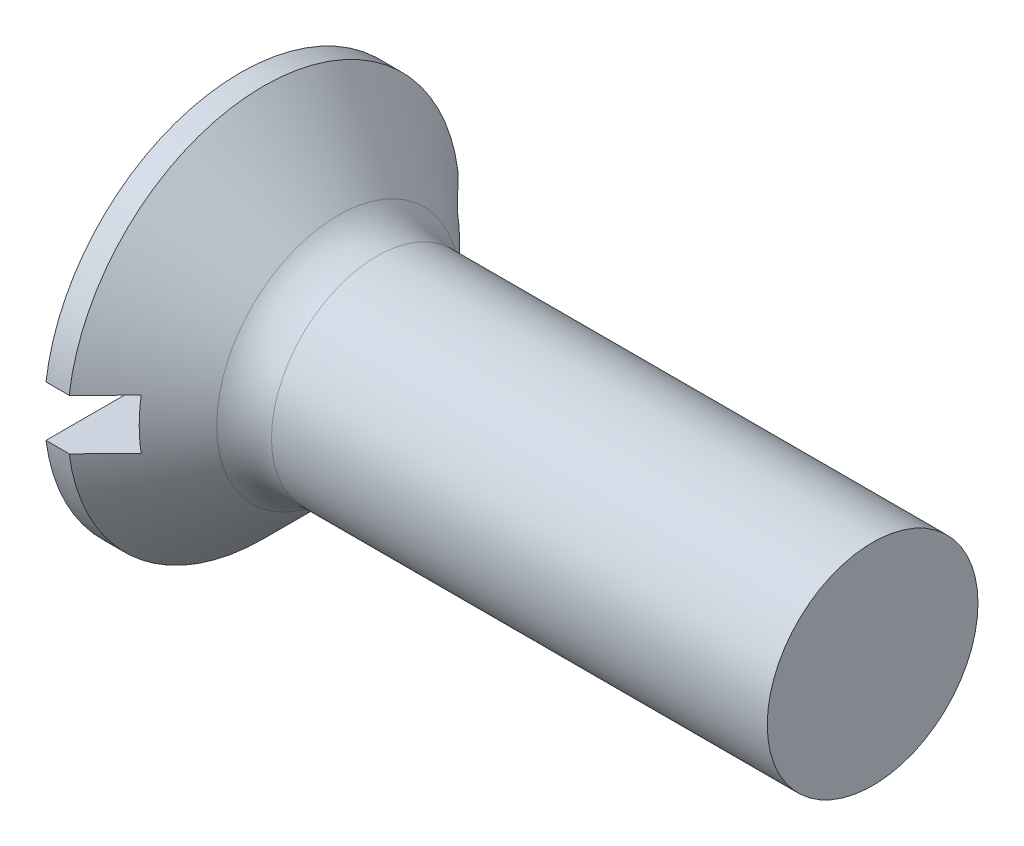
from build123d import *

# Parameters (mm, degrees)
FILLET1_R  = 1.3
SKETCH2_W  = 9.3
SKETCH2_H  = 1.2
SLOT_DEPTH = 1.4


with BuildPart() as part:
    # BodySke → Base-Revolve (revolve)
    with BuildSketch(Plane.XY, mode=Mode.PRIVATE) as base_revolve_sk:
        Polygon((0, 0), (0, 4.65), (0.55, 4.65), (2.7, 2.5), (15, 2.5), (15, 0), align=None)
    revolve(base_revolve_sk.sketch.rotate(Axis((-6.35, 0, 0), (1, 0, 0)), 90), axis=Axis((-6.35, 0, 0), (1, 0, 0)))

    # Fillet1
    fillet1_edges = [part.edges().sort_by_distance(p)[0] for p in [
        (2.7, 0, -2.5),
    ]]
    fillet(fillet1_edges, radius=FILLET1_R)

    # Sketch2 → Slot (cut)
    with BuildSketch(Plane.ZY):
        Rectangle(SKETCH2_W, SKETCH2_H)
    extrude(amount=-SLOT_DEPTH, mode=Mode.SUBTRACT)


solid = part.part
